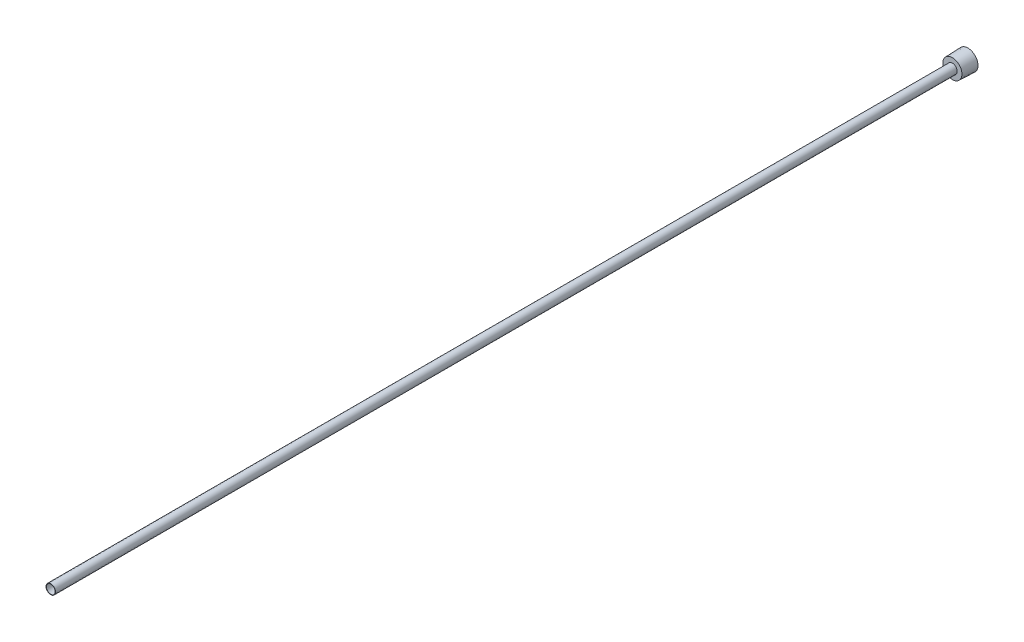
from build123d import *

# Parameters (mm, degrees)
SKETCH2_R          = 2.921
CUT_EXTRUDE1_DEPTH = 610.674036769
CUT_EXTRUDE2_DEPTH = 6.35


with BuildPart() as part:
    # Sketch1 → Revolve1 (revolve)
    with BuildSketch(Plane(origin=(0, 0, 0), x_dir=(0, 0, -1), z_dir=(1, 0, 0)), mode=Mode.PRIVATE) as revolve1_sk:
        Polygon((0, 0), (-609.6, 0), (-609.6, 3.175), (-10.3124, 3.175), (-10.3124, 6.342143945), (0, 6.7183), align=None)
    revolve(revolve1_sk.sketch.rotate(Axis((0, 0, 331.124179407), (0, 0, -1)), 90), axis=Axis((0, 0, 331.124179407), (0, 0, -1)))

    # Sketch2 → Cut-Extrude1 (cut, through all)
    with BuildSketch(Plane.XY.offset(609.6)):
        Circle(SKETCH2_R)
    extrude(amount=-CUT_EXTRUDE1_DEPTH, mode=Mode.SUBTRACT)

    # Sketch3 → Cut-Extrude2 (cut)
    with BuildSketch(Plane(origin=(0, 0, 0), x_dir=(-1, 0, 0), z_dir=(0, 0, -1))):
        Polygon((0, -3.666174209), (3.175, -1.833087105), (3.175, 1.833087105), (0, 3.666174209), (-3.175, 1.833087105), (-3.175, -1.833087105), align=None)
    extrude(amount=-CUT_EXTRUDE2_DEPTH, mode=Mode.SUBTRACT)


solid = part.part
